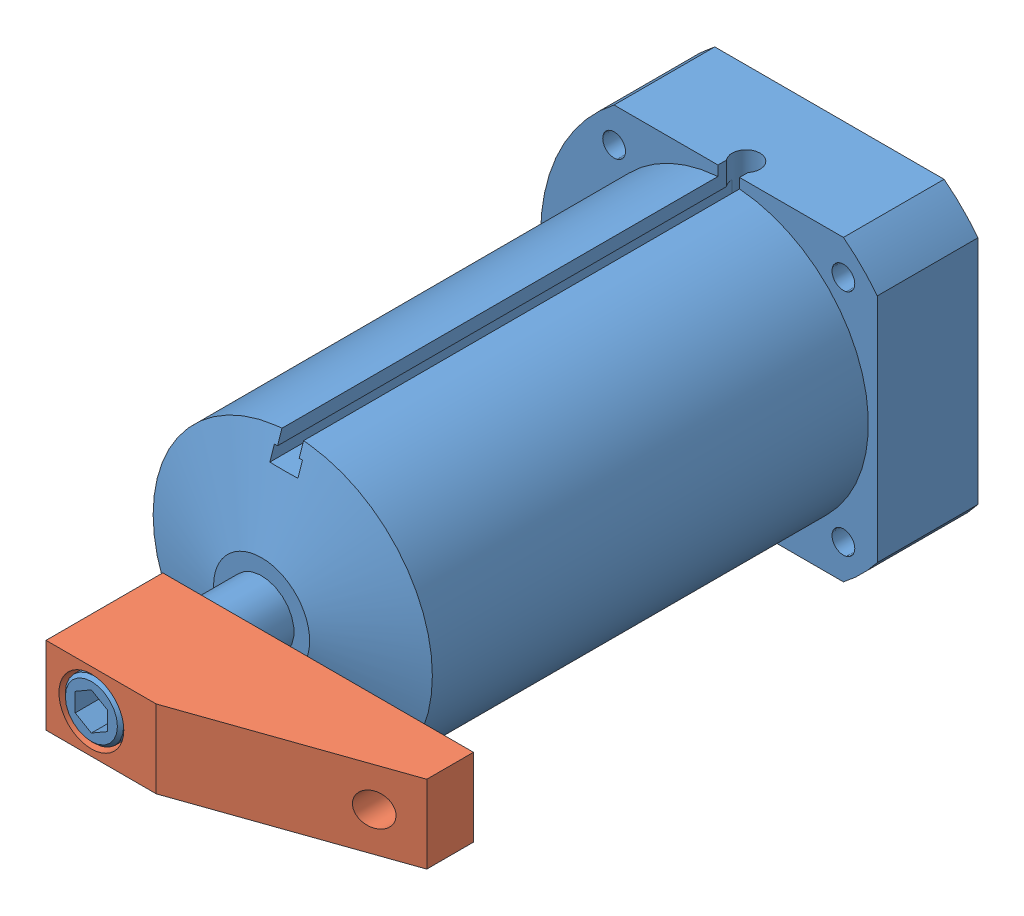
SolidWorks assembly ilcp1520100.sldasm, configuration Default (file format 4400). Lengths in mm.
Overall size (110.96 73 180.59).
2 component instances, 2 part files, 3 mates.
Components (placement in the parent):
- ilcp1520100-1: ilcp1520100.sldprt [Default] at origin size (82.38 73 180.59)
- ilc91501503-2: ilc91501503.SLDPRT [Default] at (-11.0998 -9.525 152.019) x (0 1 0) z (1 0 0) size (19.05 28.57 76.02)
Mates (geometry in assembly coordinates):
- Coincident1: coincident aligned: circle of ilcp1520100-1; plane of ilc91501503-2 through (64.9224 -9.525 152.019) normal (0 0 -1)
- Concentric1: concentric aligned: cone of ilcp1520100-1 through (0 0 152.019) axis (0 0 1); cone of ilc91501503-2 through (0 0 165.1254) axis (0 0 1)
- Parallel1: parallel aligned: plane of ilcp1520100-1 through (36.3474 28.2545 138.938) normal (1 0 0); plane of ilc91501503-2 through (64.9224 -9.525 180.594) normal (1 0 0)
